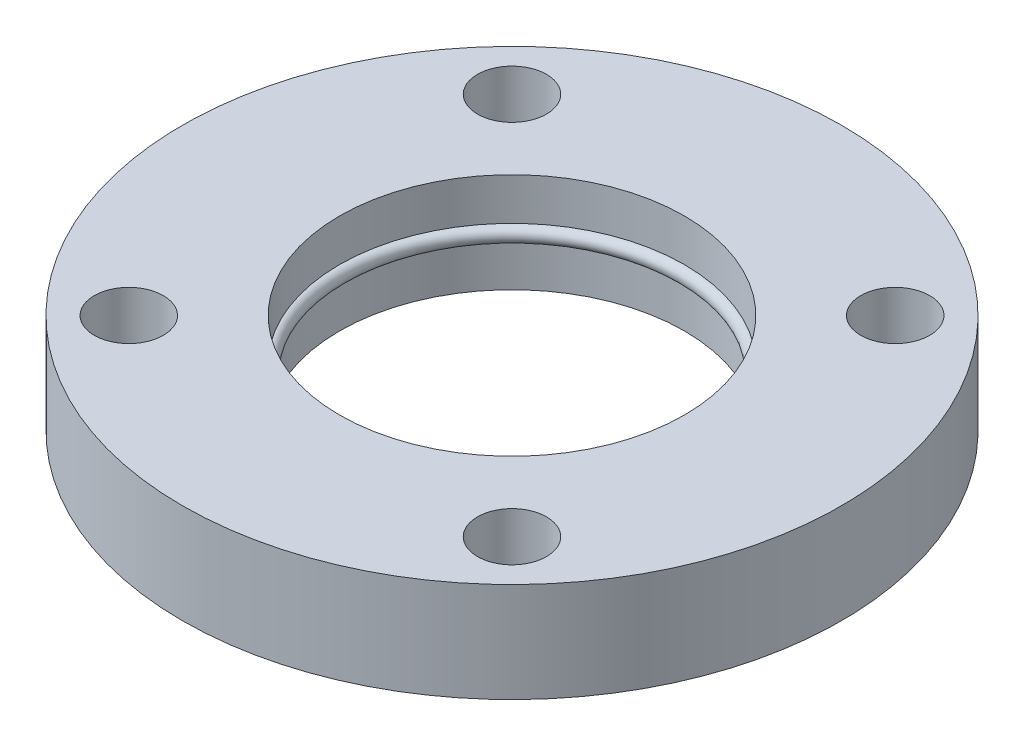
ISO-10303-21;
HEADER;
FILE_DESCRIPTION(('STEP AP214'),'2;1');
FILE_NAME('part.step','',(''),(''),'','','');
FILE_SCHEMA(('AUTOMOTIVE_DESIGN { 1 0 10303 214 1 1 1 1 }'));
ENDSEC;
DATA;
#1=APPLICATION_CONTEXT('core data for automotive mechanical design processes');
#2=APPLICATION_PROTOCOL_DEFINITION('international standard','automotive_design',2000,#1);
#3=PRODUCT_CONTEXT('',#1,'mechanical');
#4=PRODUCT('Part','Part','',(#3));
#5=PRODUCT_RELATED_PRODUCT_CATEGORY('part','',(#4));
#6=PRODUCT_DEFINITION_FORMATION('','',#4);
#7=PRODUCT_DEFINITION_CONTEXT('part definition',#1,'design');
#8=PRODUCT_DEFINITION('design','',#6,#7);
#9=PRODUCT_DEFINITION_SHAPE('','',#8);
#10=(LENGTH_UNIT() NAMED_UNIT(*) SI_UNIT(.MILLI.,.METRE.));
#11=(NAMED_UNIT(*) PLANE_ANGLE_UNIT() SI_UNIT($,.RADIAN.));
#12=(NAMED_UNIT(*) SI_UNIT($,.STERADIAN.) SOLID_ANGLE_UNIT());
#13=UNCERTAINTY_MEASURE_WITH_UNIT(LENGTH_MEASURE(1.E-05),#10,'distance_accuracy_value','');
#14=(GEOMETRIC_REPRESENTATION_CONTEXT(3) GLOBAL_UNCERTAINTY_ASSIGNED_CONTEXT((#13)) GLOBAL_UNIT_ASSIGNED_CONTEXT((#10,
#11,#12)) REPRESENTATION_CONTEXT('',''));
#15=CARTESIAN_POINT('',(0.,0.,0.));
#16=DIRECTION('',(0.,0.,1.));
#17=DIRECTION('',(1.,0.,0.));
#18=AXIS2_PLACEMENT_3D('',#15,#16,#17);
#19=CARTESIAN_POINT('',(0.,6.5,0.));
#20=DIRECTION('',(0.,-1.,0.));
#21=DIRECTION('',(0.,0.,-1.));
#22=AXIS2_PLACEMENT_3D('',#19,#20,#21);
#23=CYLINDRICAL_SURFACE('',#22,22.5);
#24=CARTESIAN_POINT('',(0.,-6.5,0.));
#25=DIRECTION('',(0.,1.,0.));
#26=DIRECTION('',(0.,0.,1.));
#27=AXIS2_PLACEMENT_3D('',#24,#25,#26);
#28=CIRCLE('',#27,22.5);
#29=CARTESIAN_POINT('',(0.,-6.5,-22.5));
#30=VERTEX_POINT('',#29);
#31=EDGE_CURVE('E50',#30,#30,#28,.T.);
#32=CARTESIAN_POINT('',(0.,-1.,0.));
#33=DIRECTION('',(0.,1.,0.));
#34=DIRECTION('',(0.,0.,1.));
#35=AXIS2_PLACEMENT_3D('',#32,#33,#34);
#36=CIRCLE('',#35,22.5);
#37=CARTESIAN_POINT('',(0.,-1.,-22.5));
#38=VERTEX_POINT('',#37);
#39=EDGE_CURVE('E38',#38,#38,#36,.T.);
#40=CARTESIAN_POINT('',(0.,-6.5,-22.5));
#41=CARTESIAN_POINT('',(0.,-6.44270833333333,-22.5));
#42=CARTESIAN_POINT('',(0.,-6.38541666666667,-22.5));
#43=CARTESIAN_POINT('',(0.,-6.27083333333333,-22.5));
#44=CARTESIAN_POINT('',(0.,-6.21354166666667,-22.5));
#45=CARTESIAN_POINT('',(0.,-6.09895833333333,-22.5));
#46=CARTESIAN_POINT('',(0.,-6.04166666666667,-22.5));
#47=CARTESIAN_POINT('',(0.,-5.92708333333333,-22.5));
#48=CARTESIAN_POINT('',(0.,-5.86979166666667,-22.5));
#49=CARTESIAN_POINT('',(0.,-5.75520833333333,-22.5));
#50=CARTESIAN_POINT('',(0.,-5.69791666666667,-22.5));
#51=CARTESIAN_POINT('',(0.,-5.58333333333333,-22.5));
#52=CARTESIAN_POINT('',(0.,-5.52604166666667,-22.5));
#53=CARTESIAN_POINT('',(0.,-5.41145833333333,-22.5));
#54=CARTESIAN_POINT('',(0.,-5.35416666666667,-22.5));
#55=CARTESIAN_POINT('',(0.,-5.23958333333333,-22.5));
#56=CARTESIAN_POINT('',(0.,-5.18229166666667,-22.5));
#57=CARTESIAN_POINT('',(0.,-5.06770833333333,-22.5));
#58=CARTESIAN_POINT('',(0.,-5.01041666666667,-22.5));
#59=CARTESIAN_POINT('',(0.,-4.89583333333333,-22.5));
#60=CARTESIAN_POINT('',(0.,-4.83854166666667,-22.5));
#61=CARTESIAN_POINT('',(0.,-4.72395833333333,-22.5));
#62=CARTESIAN_POINT('',(0.,-4.66666666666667,-22.5));
#63=CARTESIAN_POINT('',(0.,-4.55208333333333,-22.5));
#64=CARTESIAN_POINT('',(0.,-4.49479166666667,-22.5));
#65=CARTESIAN_POINT('',(0.,-4.38020833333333,-22.5));
#66=CARTESIAN_POINT('',(0.,-4.32291666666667,-22.5));
#67=CARTESIAN_POINT('',(0.,-4.20833333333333,-22.5));
#68=CARTESIAN_POINT('',(0.,-4.15104166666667,-22.5));
#69=CARTESIAN_POINT('',(0.,-4.03645833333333,-22.5));
#70=CARTESIAN_POINT('',(0.,-3.97916666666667,-22.5));
#71=CARTESIAN_POINT('',(0.,-3.86458333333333,-22.5));
#72=CARTESIAN_POINT('',(0.,-3.80729166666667,-22.5));
#73=CARTESIAN_POINT('',(0.,-3.69270833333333,-22.5));
#74=CARTESIAN_POINT('',(0.,-3.63541666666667,-22.5));
#75=CARTESIAN_POINT('',(0.,-3.52083333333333,-22.5));
#76=CARTESIAN_POINT('',(0.,-3.46354166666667,-22.5));
#77=CARTESIAN_POINT('',(0.,-3.34895833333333,-22.5));
#78=CARTESIAN_POINT('',(0.,-3.29166666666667,-22.5));
#79=CARTESIAN_POINT('',(0.,-3.17708333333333,-22.5));
#80=CARTESIAN_POINT('',(0.,-3.11979166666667,-22.5));
#81=CARTESIAN_POINT('',(0.,-3.00520833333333,-22.5));
#82=CARTESIAN_POINT('',(0.,-2.94791666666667,-22.5));
#83=CARTESIAN_POINT('',(0.,-2.83333333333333,-22.5));
#84=CARTESIAN_POINT('',(0.,-2.77604166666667,-22.5));
#85=CARTESIAN_POINT('',(0.,-2.66145833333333,-22.5));
#86=CARTESIAN_POINT('',(0.,-2.60416666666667,-22.5));
#87=CARTESIAN_POINT('',(0.,-2.48958333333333,-22.5));
#88=CARTESIAN_POINT('',(0.,-2.43229166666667,-22.5));
#89=CARTESIAN_POINT('',(0.,-2.31770833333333,-22.5));
#90=CARTESIAN_POINT('',(0.,-2.26041666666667,-22.5));
#91=CARTESIAN_POINT('',(0.,-2.14583333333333,-22.5));
#92=CARTESIAN_POINT('',(0.,-2.08854166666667,-22.5));
#93=CARTESIAN_POINT('',(0.,-1.97395833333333,-22.5));
#94=CARTESIAN_POINT('',(0.,-1.91666666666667,-22.5));
#95=CARTESIAN_POINT('',(0.,-1.80208333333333,-22.5));
#96=CARTESIAN_POINT('',(0.,-1.74479166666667,-22.5));
#97=CARTESIAN_POINT('',(0.,-1.63020833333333,-22.5));
#98=CARTESIAN_POINT('',(0.,-1.57291666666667,-22.5));
#99=CARTESIAN_POINT('',(0.,-1.45833333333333,-22.5));
#100=CARTESIAN_POINT('',(0.,-1.40104166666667,-22.5));
#101=CARTESIAN_POINT('',(0.,-1.28645833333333,-22.5));
#102=CARTESIAN_POINT('',(0.,-1.22916666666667,-22.5));
#103=CARTESIAN_POINT('',(0.,-1.11458333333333,-22.5));
#104=CARTESIAN_POINT('',(0.,-1.05729166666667,-22.5));
#105=CARTESIAN_POINT('',(0.,-1.,-22.5));
#106=B_SPLINE_CURVE_WITH_KNOTS('',3,(#40,#41,#42,#43,#44,#45,#46,#47,#48,#49,#50,#51,#52,#53,
#54,#55,#56,#57,#58,#59,#60,#61,#62,#63,#64,#65,#66,#67,#68,#69,#70,#71,#72,#73,#74,#75,#76,#77,
#78,#79,#80,#81,#82,#83,#84,#85,#86,#87,#88,#89,#90,#91,#92,#93,#94,#95,#96,#97,#98,#99,#100,
#101,#102,#103,#104,#105),.UNSPECIFIED.,.F.,.F.,(4,2,2,2,2,2,2,2,2,2,2,2,2,2,2,2,2,2,2,2,2,2,2,
2,2,2,2,2,2,2,2,2,4),(0.,0.171875,0.34375,0.515625,0.687500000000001,0.859374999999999,1.03125,
1.203125,1.375,1.546875,1.71875,1.890625,2.0625,2.234375,2.40625,2.578125,2.75,2.921875,3.09375,
3.265625,3.4375,3.609375,3.78125,3.953125,4.125,4.296875,4.46875,4.640625,4.8125,4.984375,
5.15625,5.328125,5.5),.UNSPECIFIED.);
#107=EDGE_CURVE('BSEAM34',#30,#38,#106,.T.);
#108=ORIENTED_EDGE('',*,*,#31,.F.);
#109=ORIENTED_EDGE('',*,*,#39,.T.);
#110=ORIENTED_EDGE('',*,*,#107,.T.);
#111=ORIENTED_EDGE('',*,*,#107,.F.);
#112=EDGE_LOOP('',(#108,#110,#109,#111));
#113=FACE_BOUND('',#112,.T.);
#114=ADVANCED_FACE('F34',(#113),#23,.F.);
#115=CARTESIAN_POINT('',(0.,6.5,0.));
#116=DIRECTION('',(0.,1.,0.));
#117=DIRECTION('',(0.,0.,1.));
#118=AXIS2_PLACEMENT_3D('',#115,#116,#117);
#119=CIRCLE('',#118,22.5);
#120=CARTESIAN_POINT('',(0.,6.5,-22.5));
#121=VERTEX_POINT('',#120);
#122=EDGE_CURVE('E47',#121,#121,#119,.T.);
#123=CARTESIAN_POINT('',(0.,1.,0.));
#124=DIRECTION('',(0.,-1.,0.));
#125=DIRECTION('',(0.,0.,-1.));
#126=AXIS2_PLACEMENT_3D('',#123,#124,#125);
#127=CIRCLE('',#126,22.5);
#128=CARTESIAN_POINT('',(0.,1.,-22.5));
#129=VERTEX_POINT('',#128);
#130=EDGE_CURVE('E52',#129,#129,#127,.T.);
#131=CARTESIAN_POINT('',(0.,6.5,-22.5));
#132=CARTESIAN_POINT('',(0.,6.44270833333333,-22.5));
#133=CARTESIAN_POINT('',(0.,6.38541666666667,-22.5));
#134=CARTESIAN_POINT('',(0.,6.27083333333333,-22.5));
#135=CARTESIAN_POINT('',(0.,6.21354166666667,-22.5));
#136=CARTESIAN_POINT('',(0.,6.09895833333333,-22.5));
#137=CARTESIAN_POINT('',(0.,6.04166666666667,-22.5));
#138=CARTESIAN_POINT('',(0.,5.92708333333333,-22.5));
#139=CARTESIAN_POINT('',(0.,5.86979166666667,-22.5));
#140=CARTESIAN_POINT('',(0.,5.75520833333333,-22.5));
#141=CARTESIAN_POINT('',(0.,5.69791666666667,-22.5));
#142=CARTESIAN_POINT('',(0.,5.58333333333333,-22.5));
#143=CARTESIAN_POINT('',(0.,5.52604166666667,-22.5));
#144=CARTESIAN_POINT('',(0.,5.41145833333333,-22.5));
#145=CARTESIAN_POINT('',(0.,5.35416666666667,-22.5));
#146=CARTESIAN_POINT('',(0.,5.23958333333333,-22.5));
#147=CARTESIAN_POINT('',(0.,5.18229166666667,-22.5));
#148=CARTESIAN_POINT('',(0.,5.06770833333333,-22.5));
#149=CARTESIAN_POINT('',(0.,5.01041666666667,-22.5));
#150=CARTESIAN_POINT('',(0.,4.89583333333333,-22.5));
#151=CARTESIAN_POINT('',(0.,4.83854166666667,-22.5));
#152=CARTESIAN_POINT('',(0.,4.72395833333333,-22.5));
#153=CARTESIAN_POINT('',(0.,4.66666666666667,-22.5));
#154=CARTESIAN_POINT('',(0.,4.55208333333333,-22.5));
#155=CARTESIAN_POINT('',(0.,4.49479166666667,-22.5));
#156=CARTESIAN_POINT('',(0.,4.38020833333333,-22.5));
#157=CARTESIAN_POINT('',(0.,4.32291666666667,-22.5));
#158=CARTESIAN_POINT('',(0.,4.20833333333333,-22.5));
#159=CARTESIAN_POINT('',(0.,4.15104166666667,-22.5));
#160=CARTESIAN_POINT('',(0.,4.03645833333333,-22.5));
#161=CARTESIAN_POINT('',(0.,3.97916666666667,-22.5));
#162=CARTESIAN_POINT('',(0.,3.86458333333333,-22.5));
#163=CARTESIAN_POINT('',(0.,3.80729166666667,-22.5));
#164=CARTESIAN_POINT('',(0.,3.69270833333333,-22.5));
#165=CARTESIAN_POINT('',(0.,3.63541666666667,-22.5));
#166=CARTESIAN_POINT('',(0.,3.52083333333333,-22.5));
#167=CARTESIAN_POINT('',(0.,3.46354166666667,-22.5));
#168=CARTESIAN_POINT('',(0.,3.34895833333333,-22.5));
#169=CARTESIAN_POINT('',(0.,3.29166666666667,-22.5));
#170=CARTESIAN_POINT('',(0.,3.17708333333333,-22.5));
#171=CARTESIAN_POINT('',(0.,3.11979166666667,-22.5));
#172=CARTESIAN_POINT('',(0.,3.00520833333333,-22.5));
#173=CARTESIAN_POINT('',(0.,2.94791666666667,-22.5));
#174=CARTESIAN_POINT('',(0.,2.83333333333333,-22.5));
#175=CARTESIAN_POINT('',(0.,2.77604166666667,-22.5));
#176=CARTESIAN_POINT('',(0.,2.66145833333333,-22.5));
#177=CARTESIAN_POINT('',(0.,2.60416666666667,-22.5));
#178=CARTESIAN_POINT('',(0.,2.48958333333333,-22.5));
#179=CARTESIAN_POINT('',(0.,2.43229166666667,-22.5));
#180=CARTESIAN_POINT('',(0.,2.31770833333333,-22.5));
#181=CARTESIAN_POINT('',(0.,2.26041666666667,-22.5));
#182=CARTESIAN_POINT('',(0.,2.14583333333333,-22.5));
#183=CARTESIAN_POINT('',(0.,2.08854166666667,-22.5));
#184=CARTESIAN_POINT('',(0.,1.97395833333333,-22.5));
#185=CARTESIAN_POINT('',(0.,1.91666666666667,-22.5));
#186=CARTESIAN_POINT('',(0.,1.80208333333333,-22.5));
#187=CARTESIAN_POINT('',(0.,1.74479166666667,-22.5));
#188=CARTESIAN_POINT('',(0.,1.63020833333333,-22.5));
#189=CARTESIAN_POINT('',(0.,1.57291666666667,-22.5));
#190=CARTESIAN_POINT('',(0.,1.45833333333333,-22.5));
#191=CARTESIAN_POINT('',(0.,1.40104166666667,-22.5));
#192=CARTESIAN_POINT('',(0.,1.28645833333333,-22.5));
#193=CARTESIAN_POINT('',(0.,1.22916666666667,-22.5));
#194=CARTESIAN_POINT('',(0.,1.11458333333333,-22.5));
#195=CARTESIAN_POINT('',(0.,1.05729166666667,-22.5));
#196=CARTESIAN_POINT('',(0.,1.,-22.5));
#197=B_SPLINE_CURVE_WITH_KNOTS('',3,(#131,#132,#133,#134,#135,#136,#137,#138,#139,#140,#141,
#142,#143,#144,#145,#146,#147,#148,#149,#150,#151,#152,#153,#154,#155,#156,#157,#158,#159,#160,
#161,#162,#163,#164,#165,#166,#167,#168,#169,#170,#171,#172,#173,#174,#175,#176,#177,#178,#179,
#180,#181,#182,#183,#184,#185,#186,#187,#188,#189,#190,#191,#192,#193,#194,#195,#196),
.UNSPECIFIED.,.F.,.F.,(4,2,2,2,2,2,2,2,2,2,2,2,2,2,2,2,2,2,2,2,2,2,2,2,2,2,2,2,2,2,2,2,4),(0.,
0.171874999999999,0.343749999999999,0.515625,0.687499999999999,0.859374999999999,1.03125,
1.203125,1.375,1.546875,1.71875,1.890625,2.0625,2.234375,2.40625,2.578125,2.75,2.921875,3.09375,
3.265625,3.4375,3.609375,3.78125,3.953125,4.125,4.296875,4.46875,4.640625,4.8125,4.984375,
5.15625,5.328125,5.5),.UNSPECIFIED.);
#198=EDGE_CURVE('BSEAM95',#121,#129,#197,.T.);
#199=ORIENTED_EDGE('',*,*,#122,.T.);
#200=ORIENTED_EDGE('',*,*,#130,.T.);
#201=ORIENTED_EDGE('',*,*,#198,.T.);
#202=ORIENTED_EDGE('',*,*,#198,.F.);
#203=EDGE_LOOP('',(#199,#201,#200,#202));
#204=FACE_BOUND('',#203,.T.);
#205=ADVANCED_FACE('F95',(#204),#23,.F.);
#206=CARTESIAN_POINT('',(0.,6.5,0.));
#207=DIRECTION('',(0.,1.,0.));
#208=DIRECTION('',(0.,0.,1.));
#209=AXIS2_PLACEMENT_3D('',#206,#207,#208);
#210=PLANE('',#209);
#211=CARTESIAN_POINT('',(25.,6.5,25.));
#212=DIRECTION('',(0.,1.,0.));
#213=DIRECTION('',(0.,0.,1.));
#214=AXIS2_PLACEMENT_3D('',#211,#212,#213);
#215=CIRCLE('',#214,4.5);
#216=CARTESIAN_POINT('',(25.,6.5,20.5));
#217=VERTEX_POINT('',#216);
#218=EDGE_CURVE('E69',#217,#217,#215,.T.);
#219=ORIENTED_EDGE('',*,*,#218,.F.);
#220=EDGE_LOOP('',(#219));
#221=FACE_BOUND('',#220,.T.);
#222=CARTESIAN_POINT('',(-25.,6.5,-25.));
#223=DIRECTION('',(0.,1.,0.));
#224=DIRECTION('',(0.,0.,1.));
#225=AXIS2_PLACEMENT_3D('',#222,#223,#224);
#226=CIRCLE('',#225,4.5);
#227=CARTESIAN_POINT('',(-25.,6.5,-29.5));
#228=VERTEX_POINT('',#227);
#229=EDGE_CURVE('E81',#228,#228,#226,.T.);
#230=ORIENTED_EDGE('',*,*,#229,.F.);
#231=EDGE_LOOP('',(#230));
#232=FACE_BOUND('',#231,.T.);
#233=CARTESIAN_POINT('',(0.,6.5,0.));
#234=DIRECTION('',(0.,1.,0.));
#235=DIRECTION('',(0.,0.,1.));
#236=AXIS2_PLACEMENT_3D('',#233,#234,#235);
#237=CIRCLE('',#236,43.);
#238=CARTESIAN_POINT('',(0.,6.5,-43.));
#239=VERTEX_POINT('',#238);
#240=EDGE_CURVE('E10',#239,#239,#237,.T.);
#241=ORIENTED_EDGE('',*,*,#240,.T.);
#242=EDGE_LOOP('',(#241));
#243=FACE_BOUND('',#242,.T.);
#244=ORIENTED_EDGE('',*,*,#122,.F.);
#245=EDGE_LOOP('',(#244));
#246=FACE_BOUND('',#245,.T.);
#247=CARTESIAN_POINT('',(25.,6.5,-25.));
#248=DIRECTION('',(0.,1.,0.));
#249=DIRECTION('',(0.,0.,1.));
#250=AXIS2_PLACEMENT_3D('',#247,#248,#249);
#251=CIRCLE('',#250,4.5);
#252=CARTESIAN_POINT('',(25.,6.5,-29.5));
#253=VERTEX_POINT('',#252);
#254=EDGE_CURVE('E75',#253,#253,#251,.T.);
#255=ORIENTED_EDGE('',*,*,#254,.F.);
#256=EDGE_LOOP('',(#255));
#257=FACE_BOUND('',#256,.T.);
#258=CARTESIAN_POINT('',(-25.,6.5,25.));
#259=DIRECTION('',(0.,1.,0.));
#260=DIRECTION('',(0.,0.,1.));
#261=AXIS2_PLACEMENT_3D('',#258,#259,#260);
#262=CIRCLE('',#261,4.5);
#263=CARTESIAN_POINT('',(-25.,6.5,20.5));
#264=VERTEX_POINT('',#263);
#265=EDGE_CURVE('E61',#264,#264,#262,.T.);
#266=ORIENTED_EDGE('',*,*,#265,.F.);
#267=EDGE_LOOP('',(#266));
#268=FACE_BOUND('',#267,.T.);
#269=ADVANCED_FACE('F100',(#221,#232,#243,#246,#257,#268),#210,.T.);
#270=CARTESIAN_POINT('',(0.,-6.5,0.));
#271=DIRECTION('',(0.,1.,0.));
#272=DIRECTION('',(0.,0.,1.));
#273=AXIS2_PLACEMENT_3D('',#270,#271,#272);
#274=PLANE('',#273);
#275=CARTESIAN_POINT('',(0.,-6.5,0.));
#276=DIRECTION('',(0.,1.,0.));
#277=DIRECTION('',(0.,0.,1.));
#278=AXIS2_PLACEMENT_3D('',#275,#276,#277);
#279=CIRCLE('',#278,43.);
#280=CARTESIAN_POINT('',(0.,-6.5,-43.));
#281=VERTEX_POINT('',#280);
#282=EDGE_CURVE('E42',#281,#281,#279,.T.);
#283=ORIENTED_EDGE('',*,*,#282,.F.);
#284=EDGE_LOOP('',(#283));
#285=FACE_BOUND('',#284,.T.);
#286=ORIENTED_EDGE('',*,*,#31,.T.);
#287=EDGE_LOOP('',(#286));
#288=FACE_BOUND('',#287,.T.);
#289=CARTESIAN_POINT('',(-25.,-6.5,-25.));
#290=DIRECTION('',(0.,1.,0.));
#291=DIRECTION('',(0.,0.,1.));
#292=AXIS2_PLACEMENT_3D('',#289,#290,#291);
#293=CIRCLE('',#292,4.5);
#294=CARTESIAN_POINT('',(-25.,-6.5,-29.5));
#295=VERTEX_POINT('',#294);
#296=EDGE_CURVE('E78',#295,#295,#293,.T.);
#297=ORIENTED_EDGE('',*,*,#296,.T.);
#298=EDGE_LOOP('',(#297));
#299=FACE_BOUND('',#298,.T.);
#300=CARTESIAN_POINT('',(25.,-6.5,-25.));
#301=DIRECTION('',(0.,1.,0.));
#302=DIRECTION('',(0.,0.,1.));
#303=AXIS2_PLACEMENT_3D('',#300,#301,#302);
#304=CIRCLE('',#303,4.5);
#305=CARTESIAN_POINT('',(25.,-6.5,-29.5));
#306=VERTEX_POINT('',#305);
#307=EDGE_CURVE('E72',#306,#306,#304,.T.);
#308=ORIENTED_EDGE('',*,*,#307,.T.);
#309=EDGE_LOOP('',(#308));
#310=FACE_BOUND('',#309,.T.);
#311=CARTESIAN_POINT('',(25.,-6.5,25.));
#312=DIRECTION('',(0.,1.,0.));
#313=DIRECTION('',(0.,0.,1.));
#314=AXIS2_PLACEMENT_3D('',#311,#312,#313);
#315=CIRCLE('',#314,4.5);
#316=CARTESIAN_POINT('',(25.,-6.5,20.5));
#317=VERTEX_POINT('',#316);
#318=EDGE_CURVE('E66',#317,#317,#315,.T.);
#319=ORIENTED_EDGE('',*,*,#318,.T.);
#320=EDGE_LOOP('',(#319));
#321=FACE_BOUND('',#320,.T.);
#322=CARTESIAN_POINT('',(-25.,-6.5,25.));
#323=DIRECTION('',(0.,1.,0.));
#324=DIRECTION('',(0.,0.,1.));
#325=AXIS2_PLACEMENT_3D('',#322,#323,#324);
#326=CIRCLE('',#325,4.5);
#327=CARTESIAN_POINT('',(-25.,-6.5,20.5));
#328=VERTEX_POINT('',#327);
#329=EDGE_CURVE('E57',#328,#328,#326,.T.);
#330=ORIENTED_EDGE('',*,*,#329,.T.);
#331=EDGE_LOOP('',(#330));
#332=FACE_BOUND('',#331,.T.);
#333=ADVANCED_FACE('F91',(#285,#288,#299,#310,#321,#332),#274,.F.);
#334=CARTESIAN_POINT('',(0.,6.5,0.));
#335=DIRECTION('',(0.,-1.,0.));
#336=DIRECTION('',(0.,0.,-1.));
#337=AXIS2_PLACEMENT_3D('',#334,#335,#336);
#338=CYLINDRICAL_SURFACE('',#337,43.);
#339=CARTESIAN_POINT('',(0.,6.5,-43.));
#340=CARTESIAN_POINT('',(0.,6.36458333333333,-43.));
#341=CARTESIAN_POINT('',(0.,6.22916666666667,-43.));
#342=CARTESIAN_POINT('',(0.,5.95833333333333,-43.));
#343=CARTESIAN_POINT('',(0.,5.82291666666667,-43.));
#344=CARTESIAN_POINT('',(0.,5.55208333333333,-43.));
#345=CARTESIAN_POINT('',(0.,5.41666666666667,-43.));
#346=CARTESIAN_POINT('',(0.,5.14583333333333,-43.));
#347=CARTESIAN_POINT('',(0.,5.01041666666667,-43.));
#348=CARTESIAN_POINT('',(0.,4.73958333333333,-43.));
#349=CARTESIAN_POINT('',(0.,4.60416666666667,-43.));
#350=CARTESIAN_POINT('',(0.,4.33333333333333,-43.));
#351=CARTESIAN_POINT('',(0.,4.19791666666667,-43.));
#352=CARTESIAN_POINT('',(0.,3.92708333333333,-43.));
#353=CARTESIAN_POINT('',(0.,3.79166666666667,-43.));
#354=CARTESIAN_POINT('',(0.,3.52083333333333,-43.));
#355=CARTESIAN_POINT('',(0.,3.38541666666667,-43.));
#356=CARTESIAN_POINT('',(0.,3.11458333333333,-43.));
#357=CARTESIAN_POINT('',(0.,2.97916666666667,-43.));
#358=CARTESIAN_POINT('',(0.,2.70833333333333,-43.));
#359=CARTESIAN_POINT('',(0.,2.57291666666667,-43.));
#360=CARTESIAN_POINT('',(0.,2.30208333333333,-43.));
#361=CARTESIAN_POINT('',(0.,2.16666666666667,-43.));
#362=CARTESIAN_POINT('',(0.,1.89583333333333,-43.));
#363=CARTESIAN_POINT('',(0.,1.76041666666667,-43.));
#364=CARTESIAN_POINT('',(0.,1.48958333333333,-43.));
#365=CARTESIAN_POINT('',(0.,1.35416666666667,-43.));
#366=CARTESIAN_POINT('',(0.,1.08333333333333,-43.));
#367=CARTESIAN_POINT('',(0.,0.947916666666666,-43.));
#368=CARTESIAN_POINT('',(0.,0.677083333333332,-43.));
#369=CARTESIAN_POINT('',(0.,0.541666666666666,-43.));
#370=CARTESIAN_POINT('',(0.,0.270833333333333,-43.));
#371=CARTESIAN_POINT('',(0.,0.135416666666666,-43.));
#372=CARTESIAN_POINT('',(0.,-0.135416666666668,-43.));
#373=CARTESIAN_POINT('',(0.,-0.270833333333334,-43.));
#374=CARTESIAN_POINT('',(0.,-0.541666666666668,-43.));
#375=CARTESIAN_POINT('',(0.,-0.677083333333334,-43.));
#376=CARTESIAN_POINT('',(0.,-0.947916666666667,-43.));
#377=CARTESIAN_POINT('',(0.,-1.08333333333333,-43.));
#378=CARTESIAN_POINT('',(0.,-1.35416666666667,-43.));
#379=CARTESIAN_POINT('',(0.,-1.48958333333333,-43.));
#380=CARTESIAN_POINT('',(0.,-1.76041666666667,-43.));
#381=CARTESIAN_POINT('',(0.,-1.89583333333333,-43.));
#382=CARTESIAN_POINT('',(0.,-2.16666666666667,-43.));
#383=CARTESIAN_POINT('',(0.,-2.30208333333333,-43.));
#384=CARTESIAN_POINT('',(0.,-2.57291666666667,-43.));
#385=CARTESIAN_POINT('',(0.,-2.70833333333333,-43.));
#386=CARTESIAN_POINT('',(0.,-2.97916666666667,-43.));
#387=CARTESIAN_POINT('',(0.,-3.11458333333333,-43.));
#388=CARTESIAN_POINT('',(0.,-3.38541666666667,-43.));
#389=CARTESIAN_POINT('',(0.,-3.52083333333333,-43.));
#390=CARTESIAN_POINT('',(0.,-3.79166666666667,-43.));
#391=CARTESIAN_POINT('',(0.,-3.92708333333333,-43.));
#392=CARTESIAN_POINT('',(0.,-4.19791666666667,-43.));
#393=CARTESIAN_POINT('',(0.,-4.33333333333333,-43.));
#394=CARTESIAN_POINT('',(0.,-4.60416666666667,-43.));
#395=CARTESIAN_POINT('',(0.,-4.73958333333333,-43.));
#396=CARTESIAN_POINT('',(0.,-5.01041666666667,-43.));
#397=CARTESIAN_POINT('',(0.,-5.14583333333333,-43.));
#398=CARTESIAN_POINT('',(0.,-5.41666666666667,-43.));
#399=CARTESIAN_POINT('',(0.,-5.55208333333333,-43.));
#400=CARTESIAN_POINT('',(0.,-5.82291666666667,-43.));
#401=CARTESIAN_POINT('',(0.,-5.95833333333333,-43.));
#402=CARTESIAN_POINT('',(0.,-6.22916666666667,-43.));
#403=CARTESIAN_POINT('',(0.,-6.36458333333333,-43.));
#404=CARTESIAN_POINT('',(0.,-6.5,-43.));
#405=B_SPLINE_CURVE_WITH_KNOTS('',3,(#339,#340,#341,#342,#343,#344,#345,#346,#347,#348,#349,
#350,#351,#352,#353,#354,#355,#356,#357,#358,#359,#360,#361,#362,#363,#364,#365,#366,#367,#368,
#369,#370,#371,#372,#373,#374,#375,#376,#377,#378,#379,#380,#381,#382,#383,#384,#385,#386,#387,
#388,#389,#390,#391,#392,#393,#394,#395,#396,#397,#398,#399,#400,#401,#402,#403,#404),
.UNSPECIFIED.,.F.,.F.,(4,2,2,2,2,2,2,2,2,2,2,2,2,2,2,2,2,2,2,2,2,2,2,2,2,2,2,2,2,2,2,2,4),(0.,
0.40625,0.8125,1.21875,1.625,2.03125,2.4375,2.84375,3.25,3.65625,4.0625,4.46875,4.875,5.28125,
5.6875,6.09375,6.5,6.90625,7.3125,7.71875,8.125,8.53125,8.9375,9.34375,9.75,10.15625,10.5625,
10.96875,11.375,11.78125,12.1875,12.59375,13.),.UNSPECIFIED.);
#406=EDGE_CURVE('BSEAM36',#239,#281,#405,.T.);
#407=ORIENTED_EDGE('',*,*,#240,.F.);
#408=ORIENTED_EDGE('',*,*,#282,.T.);
#409=ORIENTED_EDGE('',*,*,#406,.T.);
#410=ORIENTED_EDGE('',*,*,#406,.F.);
#411=EDGE_LOOP('',(#407,#409,#408,#410));
#412=FACE_BOUND('',#411,.T.);
#413=ADVANCED_FACE('F36',(#412),#338,.T.);
#414=CARTESIAN_POINT('',(-25.,6.5,-25.));
#415=DIRECTION('',(0.,-1.,0.));
#416=DIRECTION('',(0.,0.,-1.));
#417=AXIS2_PLACEMENT_3D('',#414,#415,#416);
#418=CYLINDRICAL_SURFACE('',#417,4.5);
#419=CARTESIAN_POINT('',(-25.,6.5,-29.5));
#420=CARTESIAN_POINT('',(-25.,6.36458333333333,-29.5));
#421=CARTESIAN_POINT('',(-25.,6.22916666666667,-29.5));
#422=CARTESIAN_POINT('',(-25.,5.95833333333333,-29.5));
#423=CARTESIAN_POINT('',(-25.,5.82291666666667,-29.5));
#424=CARTESIAN_POINT('',(-25.,5.55208333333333,-29.5));
#425=CARTESIAN_POINT('',(-25.,5.41666666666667,-29.5));
#426=CARTESIAN_POINT('',(-25.,5.14583333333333,-29.5));
#427=CARTESIAN_POINT('',(-25.,5.01041666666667,-29.5));
#428=CARTESIAN_POINT('',(-25.,4.73958333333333,-29.5));
#429=CARTESIAN_POINT('',(-25.,4.60416666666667,-29.5));
#430=CARTESIAN_POINT('',(-25.,4.33333333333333,-29.5));
#431=CARTESIAN_POINT('',(-25.,4.19791666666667,-29.5));
#432=CARTESIAN_POINT('',(-25.,3.92708333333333,-29.5));
#433=CARTESIAN_POINT('',(-25.,3.79166666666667,-29.5));
#434=CARTESIAN_POINT('',(-25.,3.52083333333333,-29.5));
#435=CARTESIAN_POINT('',(-25.,3.38541666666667,-29.5));
#436=CARTESIAN_POINT('',(-25.,3.11458333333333,-29.5));
#437=CARTESIAN_POINT('',(-25.,2.97916666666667,-29.5));
#438=CARTESIAN_POINT('',(-25.,2.70833333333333,-29.5));
#439=CARTESIAN_POINT('',(-25.,2.57291666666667,-29.5));
#440=CARTESIAN_POINT('',(-25.,2.30208333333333,-29.5));
#441=CARTESIAN_POINT('',(-25.,2.16666666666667,-29.5));
#442=CARTESIAN_POINT('',(-25.,1.89583333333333,-29.5));
#443=CARTESIAN_POINT('',(-25.,1.76041666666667,-29.5));
#444=CARTESIAN_POINT('',(-25.,1.48958333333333,-29.5));
#445=CARTESIAN_POINT('',(-25.,1.35416666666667,-29.5));
#446=CARTESIAN_POINT('',(-25.,1.08333333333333,-29.5));
#447=CARTESIAN_POINT('',(-25.,0.947916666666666,-29.5));
#448=CARTESIAN_POINT('',(-25.,0.677083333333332,-29.5));
#449=CARTESIAN_POINT('',(-25.,0.541666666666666,-29.5));
#450=CARTESIAN_POINT('',(-25.,0.270833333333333,-29.5));
#451=CARTESIAN_POINT('',(-25.,0.135416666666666,-29.5));
#452=CARTESIAN_POINT('',(-25.,-0.135416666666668,-29.5));
#453=CARTESIAN_POINT('',(-25.,-0.270833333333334,-29.5));
#454=CARTESIAN_POINT('',(-25.,-0.541666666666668,-29.5));
#455=CARTESIAN_POINT('',(-25.,-0.677083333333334,-29.5));
#456=CARTESIAN_POINT('',(-25.,-0.947916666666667,-29.5));
#457=CARTESIAN_POINT('',(-25.,-1.08333333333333,-29.5));
#458=CARTESIAN_POINT('',(-25.,-1.35416666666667,-29.5));
#459=CARTESIAN_POINT('',(-25.,-1.48958333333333,-29.5));
#460=CARTESIAN_POINT('',(-25.,-1.76041666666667,-29.5));
#461=CARTESIAN_POINT('',(-25.,-1.89583333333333,-29.5));
#462=CARTESIAN_POINT('',(-25.,-2.16666666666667,-29.5));
#463=CARTESIAN_POINT('',(-25.,-2.30208333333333,-29.5));
#464=CARTESIAN_POINT('',(-25.,-2.57291666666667,-29.5));
#465=CARTESIAN_POINT('',(-25.,-2.70833333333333,-29.5));
#466=CARTESIAN_POINT('',(-25.,-2.97916666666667,-29.5));
#467=CARTESIAN_POINT('',(-25.,-3.11458333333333,-29.5));
#468=CARTESIAN_POINT('',(-25.,-3.38541666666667,-29.5));
#469=CARTESIAN_POINT('',(-25.,-3.52083333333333,-29.5));
#470=CARTESIAN_POINT('',(-25.,-3.79166666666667,-29.5));
#471=CARTESIAN_POINT('',(-25.,-3.92708333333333,-29.5));
#472=CARTESIAN_POINT('',(-25.,-4.19791666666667,-29.5));
#473=CARTESIAN_POINT('',(-25.,-4.33333333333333,-29.5));
#474=CARTESIAN_POINT('',(-25.,-4.60416666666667,-29.5));
#475=CARTESIAN_POINT('',(-25.,-4.73958333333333,-29.5));
#476=CARTESIAN_POINT('',(-25.,-5.01041666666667,-29.5));
#477=CARTESIAN_POINT('',(-25.,-5.14583333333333,-29.5));
#478=CARTESIAN_POINT('',(-25.,-5.41666666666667,-29.5));
#479=CARTESIAN_POINT('',(-25.,-5.55208333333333,-29.5));
#480=CARTESIAN_POINT('',(-25.,-5.82291666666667,-29.5));
#481=CARTESIAN_POINT('',(-25.,-5.95833333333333,-29.5));
#482=CARTESIAN_POINT('',(-25.,-6.22916666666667,-29.5));
#483=CARTESIAN_POINT('',(-25.,-6.36458333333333,-29.5));
#484=CARTESIAN_POINT('',(-25.,-6.5,-29.5));
#485=B_SPLINE_CURVE_WITH_KNOTS('',3,(#419,#420,#421,#422,#423,#424,#425,#426,#427,#428,#429,
#430,#431,#432,#433,#434,#435,#436,#437,#438,#439,#440,#441,#442,#443,#444,#445,#446,#447,#448,
#449,#450,#451,#452,#453,#454,#455,#456,#457,#458,#459,#460,#461,#462,#463,#464,#465,#466,#467,
#468,#469,#470,#471,#472,#473,#474,#475,#476,#477,#478,#479,#480,#481,#482,#483,#484),
.UNSPECIFIED.,.F.,.F.,(4,2,2,2,2,2,2,2,2,2,2,2,2,2,2,2,2,2,2,2,2,2,2,2,2,2,2,2,2,2,2,2,4),(0.,
0.40625,0.8125,1.21875,1.625,2.03125,2.4375,2.84375,3.25,3.65625,4.0625,4.46875,4.875,5.28125,
5.6875,6.09375,6.5,6.90625,7.3125,7.71875,8.125,8.53125,8.9375,9.34375,9.75,10.15625,10.5625,
10.96875,11.375,11.78125,12.1875,12.59375,13.),.UNSPECIFIED.);
#486=EDGE_CURVE('BSEAM103',#228,#295,#485,.T.);
#487=ORIENTED_EDGE('',*,*,#229,.T.);
#488=ORIENTED_EDGE('',*,*,#296,.F.);
#489=ORIENTED_EDGE('',*,*,#486,.T.);
#490=ORIENTED_EDGE('',*,*,#486,.F.);
#491=EDGE_LOOP('',(#487,#489,#488,#490));
#492=FACE_BOUND('',#491,.T.);
#493=ADVANCED_FACE('F103',(#492),#418,.F.);
#494=CARTESIAN_POINT('',(25.,6.5,-25.));
#495=DIRECTION('',(0.,-1.,0.));
#496=DIRECTION('',(0.,0.,-1.));
#497=AXIS2_PLACEMENT_3D('',#494,#495,#496);
#498=CYLINDRICAL_SURFACE('',#497,4.5);
#499=CARTESIAN_POINT('',(25.,6.5,-29.5));
#500=CARTESIAN_POINT('',(25.,6.36458333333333,-29.5));
#501=CARTESIAN_POINT('',(25.,6.22916666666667,-29.5));
#502=CARTESIAN_POINT('',(25.,5.95833333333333,-29.5));
#503=CARTESIAN_POINT('',(25.,5.82291666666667,-29.5));
#504=CARTESIAN_POINT('',(25.,5.55208333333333,-29.5));
#505=CARTESIAN_POINT('',(25.,5.41666666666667,-29.5));
#506=CARTESIAN_POINT('',(25.,5.14583333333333,-29.5));
#507=CARTESIAN_POINT('',(25.,5.01041666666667,-29.5));
#508=CARTESIAN_POINT('',(25.,4.73958333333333,-29.5));
#509=CARTESIAN_POINT('',(25.,4.60416666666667,-29.5));
#510=CARTESIAN_POINT('',(25.,4.33333333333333,-29.5));
#511=CARTESIAN_POINT('',(25.,4.19791666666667,-29.5));
#512=CARTESIAN_POINT('',(25.,3.92708333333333,-29.5));
#513=CARTESIAN_POINT('',(25.,3.79166666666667,-29.5));
#514=CARTESIAN_POINT('',(25.,3.52083333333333,-29.5));
#515=CARTESIAN_POINT('',(25.,3.38541666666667,-29.5));
#516=CARTESIAN_POINT('',(25.,3.11458333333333,-29.5));
#517=CARTESIAN_POINT('',(25.,2.97916666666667,-29.5));
#518=CARTESIAN_POINT('',(25.,2.70833333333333,-29.5));
#519=CARTESIAN_POINT('',(25.,2.57291666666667,-29.5));
#520=CARTESIAN_POINT('',(25.,2.30208333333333,-29.5));
#521=CARTESIAN_POINT('',(25.,2.16666666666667,-29.5));
#522=CARTESIAN_POINT('',(25.,1.89583333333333,-29.5));
#523=CARTESIAN_POINT('',(25.,1.76041666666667,-29.5));
#524=CARTESIAN_POINT('',(25.,1.48958333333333,-29.5));
#525=CARTESIAN_POINT('',(25.,1.35416666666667,-29.5));
#526=CARTESIAN_POINT('',(25.,1.08333333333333,-29.5));
#527=CARTESIAN_POINT('',(25.,0.947916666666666,-29.5));
#528=CARTESIAN_POINT('',(25.,0.677083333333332,-29.5));
#529=CARTESIAN_POINT('',(25.,0.541666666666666,-29.5));
#530=CARTESIAN_POINT('',(25.,0.270833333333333,-29.5));
#531=CARTESIAN_POINT('',(25.,0.135416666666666,-29.5));
#532=CARTESIAN_POINT('',(25.,-0.135416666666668,-29.5));
#533=CARTESIAN_POINT('',(25.,-0.270833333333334,-29.5));
#534=CARTESIAN_POINT('',(25.,-0.541666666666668,-29.5));
#535=CARTESIAN_POINT('',(25.,-0.677083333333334,-29.5));
#536=CARTESIAN_POINT('',(25.,-0.947916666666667,-29.5));
#537=CARTESIAN_POINT('',(25.,-1.08333333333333,-29.5));
#538=CARTESIAN_POINT('',(25.,-1.35416666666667,-29.5));
#539=CARTESIAN_POINT('',(25.,-1.48958333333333,-29.5));
#540=CARTESIAN_POINT('',(25.,-1.76041666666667,-29.5));
#541=CARTESIAN_POINT('',(25.,-1.89583333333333,-29.5));
#542=CARTESIAN_POINT('',(25.,-2.16666666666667,-29.5));
#543=CARTESIAN_POINT('',(25.,-2.30208333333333,-29.5));
#544=CARTESIAN_POINT('',(25.,-2.57291666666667,-29.5));
#545=CARTESIAN_POINT('',(25.,-2.70833333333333,-29.5));
#546=CARTESIAN_POINT('',(25.,-2.97916666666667,-29.5));
#547=CARTESIAN_POINT('',(25.,-3.11458333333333,-29.5));
#548=CARTESIAN_POINT('',(25.,-3.38541666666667,-29.5));
#549=CARTESIAN_POINT('',(25.,-3.52083333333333,-29.5));
#550=CARTESIAN_POINT('',(25.,-3.79166666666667,-29.5));
#551=CARTESIAN_POINT('',(25.,-3.92708333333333,-29.5));
#552=CARTESIAN_POINT('',(25.,-4.19791666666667,-29.5));
#553=CARTESIAN_POINT('',(25.,-4.33333333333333,-29.5));
#554=CARTESIAN_POINT('',(25.,-4.60416666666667,-29.5));
#555=CARTESIAN_POINT('',(25.,-4.73958333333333,-29.5));
#556=CARTESIAN_POINT('',(25.,-5.01041666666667,-29.5));
#557=CARTESIAN_POINT('',(25.,-5.14583333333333,-29.5));
#558=CARTESIAN_POINT('',(25.,-5.41666666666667,-29.5));
#559=CARTESIAN_POINT('',(25.,-5.55208333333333,-29.5));
#560=CARTESIAN_POINT('',(25.,-5.82291666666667,-29.5));
#561=CARTESIAN_POINT('',(25.,-5.95833333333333,-29.5));
#562=CARTESIAN_POINT('',(25.,-6.22916666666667,-29.5));
#563=CARTESIAN_POINT('',(25.,-6.36458333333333,-29.5));
#564=CARTESIAN_POINT('',(25.,-6.5,-29.5));
#565=B_SPLINE_CURVE_WITH_KNOTS('',3,(#499,#500,#501,#502,#503,#504,#505,#506,#507,#508,#509,
#510,#511,#512,#513,#514,#515,#516,#517,#518,#519,#520,#521,#522,#523,#524,#525,#526,#527,#528,
#529,#530,#531,#532,#533,#534,#535,#536,#537,#538,#539,#540,#541,#542,#543,#544,#545,#546,#547,
#548,#549,#550,#551,#552,#553,#554,#555,#556,#557,#558,#559,#560,#561,#562,#563,#564),
.UNSPECIFIED.,.F.,.F.,(4,2,2,2,2,2,2,2,2,2,2,2,2,2,2,2,2,2,2,2,2,2,2,2,2,2,2,2,2,2,2,2,4),(0.,
0.40625,0.8125,1.21875,1.625,2.03125,2.4375,2.84375,3.25,3.65625,4.0625,4.46875,4.875,5.28125,
5.6875,6.09375,6.5,6.90625,7.3125,7.71875,8.125,8.53125,8.9375,9.34375,9.75,10.15625,10.5625,
10.96875,11.375,11.78125,12.1875,12.59375,13.),.UNSPECIFIED.);
#566=EDGE_CURVE('BSEAM118',#253,#306,#565,.T.);
#567=ORIENTED_EDGE('',*,*,#254,.T.);
#568=ORIENTED_EDGE('',*,*,#307,.F.);
#569=ORIENTED_EDGE('',*,*,#566,.T.);
#570=ORIENTED_EDGE('',*,*,#566,.F.);
#571=EDGE_LOOP('',(#567,#569,#568,#570));
#572=FACE_BOUND('',#571,.T.);
#573=ADVANCED_FACE('F118',(#572),#498,.F.);
#574=CARTESIAN_POINT('',(25.,6.5,25.));
#575=DIRECTION('',(0.,-1.,0.));
#576=DIRECTION('',(0.,0.,-1.));
#577=AXIS2_PLACEMENT_3D('',#574,#575,#576);
#578=CYLINDRICAL_SURFACE('',#577,4.5);
#579=CARTESIAN_POINT('',(25.,6.5,20.5));
#580=CARTESIAN_POINT('',(25.,6.36458333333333,20.5));
#581=CARTESIAN_POINT('',(25.,6.22916666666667,20.5));
#582=CARTESIAN_POINT('',(25.,5.95833333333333,20.5));
#583=CARTESIAN_POINT('',(25.,5.82291666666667,20.5));
#584=CARTESIAN_POINT('',(25.,5.55208333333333,20.5));
#585=CARTESIAN_POINT('',(25.,5.41666666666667,20.5));
#586=CARTESIAN_POINT('',(25.,5.14583333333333,20.5));
#587=CARTESIAN_POINT('',(25.,5.01041666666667,20.5));
#588=CARTESIAN_POINT('',(25.,4.73958333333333,20.5));
#589=CARTESIAN_POINT('',(25.,4.60416666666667,20.5));
#590=CARTESIAN_POINT('',(25.,4.33333333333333,20.5));
#591=CARTESIAN_POINT('',(25.,4.19791666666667,20.5));
#592=CARTESIAN_POINT('',(25.,3.92708333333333,20.5));
#593=CARTESIAN_POINT('',(25.,3.79166666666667,20.5));
#594=CARTESIAN_POINT('',(25.,3.52083333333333,20.5));
#595=CARTESIAN_POINT('',(25.,3.38541666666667,20.5));
#596=CARTESIAN_POINT('',(25.,3.11458333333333,20.5));
#597=CARTESIAN_POINT('',(25.,2.97916666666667,20.5));
#598=CARTESIAN_POINT('',(25.,2.70833333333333,20.5));
#599=CARTESIAN_POINT('',(25.,2.57291666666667,20.5));
#600=CARTESIAN_POINT('',(25.,2.30208333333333,20.5));
#601=CARTESIAN_POINT('',(25.,2.16666666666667,20.5));
#602=CARTESIAN_POINT('',(25.,1.89583333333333,20.5));
#603=CARTESIAN_POINT('',(25.,1.76041666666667,20.5));
#604=CARTESIAN_POINT('',(25.,1.48958333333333,20.5));
#605=CARTESIAN_POINT('',(25.,1.35416666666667,20.5));
#606=CARTESIAN_POINT('',(25.,1.08333333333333,20.5));
#607=CARTESIAN_POINT('',(25.,0.947916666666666,20.5));
#608=CARTESIAN_POINT('',(25.,0.677083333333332,20.5));
#609=CARTESIAN_POINT('',(25.,0.541666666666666,20.5));
#610=CARTESIAN_POINT('',(25.,0.270833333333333,20.5));
#611=CARTESIAN_POINT('',(25.,0.135416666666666,20.5));
#612=CARTESIAN_POINT('',(25.,-0.135416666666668,20.5));
#613=CARTESIAN_POINT('',(25.,-0.270833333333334,20.5));
#614=CARTESIAN_POINT('',(25.,-0.541666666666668,20.5));
#615=CARTESIAN_POINT('',(25.,-0.677083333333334,20.5));
#616=CARTESIAN_POINT('',(25.,-0.947916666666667,20.5));
#617=CARTESIAN_POINT('',(25.,-1.08333333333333,20.5));
#618=CARTESIAN_POINT('',(25.,-1.35416666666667,20.5));
#619=CARTESIAN_POINT('',(25.,-1.48958333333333,20.5));
#620=CARTESIAN_POINT('',(25.,-1.76041666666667,20.5));
#621=CARTESIAN_POINT('',(25.,-1.89583333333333,20.5));
#622=CARTESIAN_POINT('',(25.,-2.16666666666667,20.5));
#623=CARTESIAN_POINT('',(25.,-2.30208333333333,20.5));
#624=CARTESIAN_POINT('',(25.,-2.57291666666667,20.5));
#625=CARTESIAN_POINT('',(25.,-2.70833333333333,20.5));
#626=CARTESIAN_POINT('',(25.,-2.97916666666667,20.5));
#627=CARTESIAN_POINT('',(25.,-3.11458333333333,20.5));
#628=CARTESIAN_POINT('',(25.,-3.38541666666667,20.5));
#629=CARTESIAN_POINT('',(25.,-3.52083333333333,20.5));
#630=CARTESIAN_POINT('',(25.,-3.79166666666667,20.5));
#631=CARTESIAN_POINT('',(25.,-3.92708333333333,20.5));
#632=CARTESIAN_POINT('',(25.,-4.19791666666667,20.5));
#633=CARTESIAN_POINT('',(25.,-4.33333333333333,20.5));
#634=CARTESIAN_POINT('',(25.,-4.60416666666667,20.5));
#635=CARTESIAN_POINT('',(25.,-4.73958333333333,20.5));
#636=CARTESIAN_POINT('',(25.,-5.01041666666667,20.5));
#637=CARTESIAN_POINT('',(25.,-5.14583333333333,20.5));
#638=CARTESIAN_POINT('',(25.,-5.41666666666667,20.5));
#639=CARTESIAN_POINT('',(25.,-5.55208333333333,20.5));
#640=CARTESIAN_POINT('',(25.,-5.82291666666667,20.5));
#641=CARTESIAN_POINT('',(25.,-5.95833333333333,20.5));
#642=CARTESIAN_POINT('',(25.,-6.22916666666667,20.5));
#643=CARTESIAN_POINT('',(25.,-6.36458333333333,20.5));
#644=CARTESIAN_POINT('',(25.,-6.5,20.5));
#645=B_SPLINE_CURVE_WITH_KNOTS('',3,(#579,#580,#581,#582,#583,#584,#585,#586,#587,#588,#589,
#590,#591,#592,#593,#594,#595,#596,#597,#598,#599,#600,#601,#602,#603,#604,#605,#606,#607,#608,
#609,#610,#611,#612,#613,#614,#615,#616,#617,#618,#619,#620,#621,#622,#623,#624,#625,#626,#627,
#628,#629,#630,#631,#632,#633,#634,#635,#636,#637,#638,#639,#640,#641,#642,#643,#644),
.UNSPECIFIED.,.F.,.F.,(4,2,2,2,2,2,2,2,2,2,2,2,2,2,2,2,2,2,2,2,2,2,2,2,2,2,2,2,2,2,2,2,4),(0.,
0.40625,0.8125,1.21875,1.625,2.03125,2.4375,2.84375,3.25,3.65625,4.0625,4.46875,4.875,5.28125,
5.6875,6.09375,6.5,6.90625,7.3125,7.71875,8.125,8.53125,8.9375,9.34375,9.75,10.15625,10.5625,
10.96875,11.375,11.78125,12.1875,12.59375,13.),.UNSPECIFIED.);
#646=EDGE_CURVE('BSEAM123',#217,#317,#645,.T.);
#647=ORIENTED_EDGE('',*,*,#218,.T.);
#648=ORIENTED_EDGE('',*,*,#318,.F.);
#649=ORIENTED_EDGE('',*,*,#646,.T.);
#650=ORIENTED_EDGE('',*,*,#646,.F.);
#651=EDGE_LOOP('',(#647,#649,#648,#650));
#652=FACE_BOUND('',#651,.T.);
#653=ADVANCED_FACE('F123',(#652),#578,.F.);
#654=CARTESIAN_POINT('',(-25.,6.5,25.));
#655=DIRECTION('',(0.,-1.,0.));
#656=DIRECTION('',(0.,0.,-1.));
#657=AXIS2_PLACEMENT_3D('',#654,#655,#656);
#658=CYLINDRICAL_SURFACE('',#657,4.5);
#659=CARTESIAN_POINT('',(-25.,6.5,20.5));
#660=CARTESIAN_POINT('',(-25.,6.36458333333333,20.5));
#661=CARTESIAN_POINT('',(-25.,6.22916666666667,20.5));
#662=CARTESIAN_POINT('',(-25.,5.95833333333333,20.5));
#663=CARTESIAN_POINT('',(-25.,5.82291666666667,20.5));
#664=CARTESIAN_POINT('',(-25.,5.55208333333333,20.5));
#665=CARTESIAN_POINT('',(-25.,5.41666666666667,20.5));
#666=CARTESIAN_POINT('',(-25.,5.14583333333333,20.5));
#667=CARTESIAN_POINT('',(-25.,5.01041666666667,20.5));
#668=CARTESIAN_POINT('',(-25.,4.73958333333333,20.5));
#669=CARTESIAN_POINT('',(-25.,4.60416666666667,20.5));
#670=CARTESIAN_POINT('',(-25.,4.33333333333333,20.5));
#671=CARTESIAN_POINT('',(-25.,4.19791666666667,20.5));
#672=CARTESIAN_POINT('',(-25.,3.92708333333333,20.5));
#673=CARTESIAN_POINT('',(-25.,3.79166666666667,20.5));
#674=CARTESIAN_POINT('',(-25.,3.52083333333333,20.5));
#675=CARTESIAN_POINT('',(-25.,3.38541666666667,20.5));
#676=CARTESIAN_POINT('',(-25.,3.11458333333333,20.5));
#677=CARTESIAN_POINT('',(-25.,2.97916666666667,20.5));
#678=CARTESIAN_POINT('',(-25.,2.70833333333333,20.5));
#679=CARTESIAN_POINT('',(-25.,2.57291666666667,20.5));
#680=CARTESIAN_POINT('',(-25.,2.30208333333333,20.5));
#681=CARTESIAN_POINT('',(-25.,2.16666666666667,20.5));
#682=CARTESIAN_POINT('',(-25.,1.89583333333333,20.5));
#683=CARTESIAN_POINT('',(-25.,1.76041666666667,20.5));
#684=CARTESIAN_POINT('',(-25.,1.48958333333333,20.5));
#685=CARTESIAN_POINT('',(-25.,1.35416666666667,20.5));
#686=CARTESIAN_POINT('',(-25.,1.08333333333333,20.5));
#687=CARTESIAN_POINT('',(-25.,0.947916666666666,20.5));
#688=CARTESIAN_POINT('',(-25.,0.677083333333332,20.5));
#689=CARTESIAN_POINT('',(-25.,0.541666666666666,20.5));
#690=CARTESIAN_POINT('',(-25.,0.270833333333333,20.5));
#691=CARTESIAN_POINT('',(-25.,0.135416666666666,20.5));
#692=CARTESIAN_POINT('',(-25.,-0.135416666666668,20.5));
#693=CARTESIAN_POINT('',(-25.,-0.270833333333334,20.5));
#694=CARTESIAN_POINT('',(-25.,-0.541666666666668,20.5));
#695=CARTESIAN_POINT('',(-25.,-0.677083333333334,20.5));
#696=CARTESIAN_POINT('',(-25.,-0.947916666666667,20.5));
#697=CARTESIAN_POINT('',(-25.,-1.08333333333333,20.5));
#698=CARTESIAN_POINT('',(-25.,-1.35416666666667,20.5));
#699=CARTESIAN_POINT('',(-25.,-1.48958333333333,20.5));
#700=CARTESIAN_POINT('',(-25.,-1.76041666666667,20.5));
#701=CARTESIAN_POINT('',(-25.,-1.89583333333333,20.5));
#702=CARTESIAN_POINT('',(-25.,-2.16666666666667,20.5));
#703=CARTESIAN_POINT('',(-25.,-2.30208333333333,20.5));
#704=CARTESIAN_POINT('',(-25.,-2.57291666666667,20.5));
#705=CARTESIAN_POINT('',(-25.,-2.70833333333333,20.5));
#706=CARTESIAN_POINT('',(-25.,-2.97916666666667,20.5));
#707=CARTESIAN_POINT('',(-25.,-3.11458333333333,20.5));
#708=CARTESIAN_POINT('',(-25.,-3.38541666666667,20.5));
#709=CARTESIAN_POINT('',(-25.,-3.52083333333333,20.5));
#710=CARTESIAN_POINT('',(-25.,-3.79166666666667,20.5));
#711=CARTESIAN_POINT('',(-25.,-3.92708333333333,20.5));
#712=CARTESIAN_POINT('',(-25.,-4.19791666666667,20.5));
#713=CARTESIAN_POINT('',(-25.,-4.33333333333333,20.5));
#714=CARTESIAN_POINT('',(-25.,-4.60416666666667,20.5));
#715=CARTESIAN_POINT('',(-25.,-4.73958333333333,20.5));
#716=CARTESIAN_POINT('',(-25.,-5.01041666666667,20.5));
#717=CARTESIAN_POINT('',(-25.,-5.14583333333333,20.5));
#718=CARTESIAN_POINT('',(-25.,-5.41666666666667,20.5));
#719=CARTESIAN_POINT('',(-25.,-5.55208333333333,20.5));
#720=CARTESIAN_POINT('',(-25.,-5.82291666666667,20.5));
#721=CARTESIAN_POINT('',(-25.,-5.95833333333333,20.5));
#722=CARTESIAN_POINT('',(-25.,-6.22916666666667,20.5));
#723=CARTESIAN_POINT('',(-25.,-6.36458333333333,20.5));
#724=CARTESIAN_POINT('',(-25.,-6.5,20.5));
#725=B_SPLINE_CURVE_WITH_KNOTS('',3,(#659,#660,#661,#662,#663,#664,#665,#666,#667,#668,#669,
#670,#671,#672,#673,#674,#675,#676,#677,#678,#679,#680,#681,#682,#683,#684,#685,#686,#687,#688,
#689,#690,#691,#692,#693,#694,#695,#696,#697,#698,#699,#700,#701,#702,#703,#704,#705,#706,#707,
#708,#709,#710,#711,#712,#713,#714,#715,#716,#717,#718,#719,#720,#721,#722,#723,#724),
.UNSPECIFIED.,.F.,.F.,(4,2,2,2,2,2,2,2,2,2,2,2,2,2,2,2,2,2,2,2,2,2,2,2,2,2,2,2,2,2,2,2,4),(0.,
0.40625,0.8125,1.21875,1.625,2.03125,2.4375,2.84375,3.25,3.65625,4.0625,4.46875,4.875,5.28125,
5.6875,6.09375,6.5,6.90625,7.3125,7.71875,8.125,8.53125,8.9375,9.34375,9.75,10.15625,10.5625,
10.96875,11.375,11.78125,12.1875,12.59375,13.),.UNSPECIFIED.);
#726=EDGE_CURVE('BSEAM134',#264,#328,#725,.T.);
#727=ORIENTED_EDGE('',*,*,#265,.T.);
#728=ORIENTED_EDGE('',*,*,#329,.F.);
#729=ORIENTED_EDGE('',*,*,#726,.T.);
#730=ORIENTED_EDGE('',*,*,#726,.F.);
#731=EDGE_LOOP('',(#727,#729,#728,#730));
#732=FACE_BOUND('',#731,.T.);
#733=ADVANCED_FACE('F134',(#732),#658,.F.);
#734=CARTESIAN_POINT('',(0.,0.,0.));
#735=DIRECTION('',(0.,-1.,0.));
#736=DIRECTION('',(0.,0.,-1.));
#737=AXIS2_PLACEMENT_3D('',#734,#735,#736);
#738=TOROIDAL_SURFACE('',#737,22.5,1.);
#739=ORIENTED_EDGE('',*,*,#130,.F.);
#740=EDGE_LOOP('',(#739));
#741=FACE_BOUND('',#740,.T.);
#742=ORIENTED_EDGE('',*,*,#39,.F.);
#743=EDGE_LOOP('',(#742));
#744=FACE_BOUND('',#743,.T.);
#745=ADVANCED_FACE('F140',(#741,#744),#738,.T.);
#746=CLOSED_SHELL('',(#114,#205,#269,#333,#413,#493,#573,#653,#733,#745));
#747=MANIFOLD_SOLID_BREP('B2',#746);
#748=ADVANCED_BREP_SHAPE_REPRESENTATION('',(#18,#747),#14);
#749=SHAPE_DEFINITION_REPRESENTATION(#9,#748);
ENDSEC;
END-ISO-10303-21;
